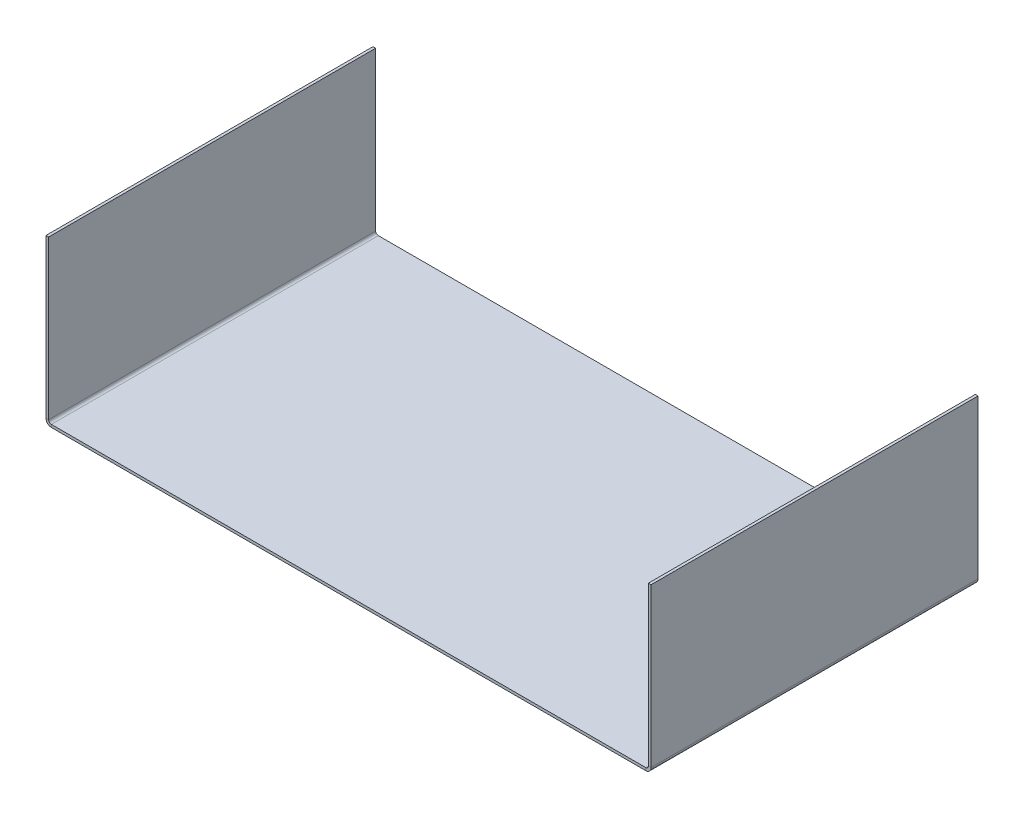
ISO-10303-21;
HEADER;
FILE_DESCRIPTION(('STEP AP214'),'2;1');
FILE_NAME('part.step','',(''),(''),'','','');
FILE_SCHEMA(('AUTOMOTIVE_DESIGN { 1 0 10303 214 1 1 1 1 }'));
ENDSEC;
DATA;
#1=APPLICATION_CONTEXT('core data for automotive mechanical design processes');
#2=APPLICATION_PROTOCOL_DEFINITION('international standard','automotive_design',2000,#1);
#3=PRODUCT_CONTEXT('',#1,'mechanical');
#4=PRODUCT('Part','Part','',(#3));
#5=PRODUCT_RELATED_PRODUCT_CATEGORY('part','',(#4));
#6=PRODUCT_DEFINITION_FORMATION('','',#4);
#7=PRODUCT_DEFINITION_CONTEXT('part definition',#1,'design');
#8=PRODUCT_DEFINITION('design','',#6,#7);
#9=PRODUCT_DEFINITION_SHAPE('','',#8);
#10=(LENGTH_UNIT() NAMED_UNIT(*) SI_UNIT(.MILLI.,.METRE.));
#11=(NAMED_UNIT(*) PLANE_ANGLE_UNIT() SI_UNIT($,.RADIAN.));
#12=(NAMED_UNIT(*) SI_UNIT($,.STERADIAN.) SOLID_ANGLE_UNIT());
#13=UNCERTAINTY_MEASURE_WITH_UNIT(LENGTH_MEASURE(1.E-05),#10,'distance_accuracy_value','');
#14=(GEOMETRIC_REPRESENTATION_CONTEXT(3) GLOBAL_UNCERTAINTY_ASSIGNED_CONTEXT((#13)) GLOBAL_UNIT_ASSIGNED_CONTEXT((#10,
#11,#12)) REPRESENTATION_CONTEXT('',''));
#15=CARTESIAN_POINT('',(0.,0.,0.));
#16=DIRECTION('',(0.,0.,1.));
#17=DIRECTION('',(1.,0.,0.));
#18=AXIS2_PLACEMENT_3D('',#15,#16,#17);
#19=CARTESIAN_POINT('',(0.,-0.7366,0.));
#20=DIRECTION('',(0.,1.,0.));
#21=DIRECTION('',(0.,0.,1.));
#22=AXIS2_PLACEMENT_3D('',#19,#20,#21);
#23=PLANE('',#22);
#24=DIRECTION('',(0.,0.,-1.));
#25=VECTOR('',#24,1.);
#26=CARTESIAN_POINT('',(76.8963049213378,-0.736599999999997,-44.5016904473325));
#27=LINE('',#26,#25);
#28=CARTESIAN_POINT('',(76.8963049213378,-0.736599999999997,-44.5016904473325));
#29=VERTEX_POINT('',#28);
#30=CARTESIAN_POINT('',(76.8963049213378,-0.7366,45.2858612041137));
#31=VERTEX_POINT('',#30);
#32=EDGE_CURVE('E133',#29,#31,#27,.F.);
#33=ORIENTED_EDGE('',*,*,#32,.T.);
#34=DIRECTION('',(1.,0.,0.));
#35=VECTOR('',#34,1.);
#36=CARTESIAN_POINT('',(-87.0429540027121,-0.7366,45.2858612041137));
#37=LINE('',#36,#35);
#38=CARTESIAN_POINT('',(-86.3063540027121,-0.736599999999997,45.2858612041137));
#39=VERTEX_POINT('',#38);
#40=EDGE_CURVE('E44',#39,#31,#37,.T.);
#41=ORIENTED_EDGE('',*,*,#40,.F.);
#42=DIRECTION('',(0.,0.,1.));
#43=VECTOR('',#42,1.);
#44=CARTESIAN_POINT('',(-86.3063540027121,-0.736599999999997,45.2858612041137));
#45=LINE('',#44,#43);
#46=CARTESIAN_POINT('',(-86.3063540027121,-0.7366,-44.5016904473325));
#47=VERTEX_POINT('',#46);
#48=EDGE_CURVE('E222',#39,#47,#45,.F.);
#49=ORIENTED_EDGE('',*,*,#48,.T.);
#50=DIRECTION('',(-1.,0.,0.));
#51=VECTOR('',#50,1.);
#52=CARTESIAN_POINT('',(-87.0429540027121,-0.7366,-44.5016904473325));
#53=LINE('',#52,#51);
#54=EDGE_CURVE('E11',#29,#47,#53,.T.);
#55=ORIENTED_EDGE('',*,*,#54,.F.);
#56=EDGE_LOOP('',(#33,#41,#49,#55));
#57=FACE_BOUND('',#56,.T.);
#58=ADVANCED_FACE('F35',(#57),#23,.F.);
#59=CARTESIAN_POINT('',(0.,0.,0.));
#60=DIRECTION('',(0.,1.,0.));
#61=DIRECTION('',(0.,0.,1.));
#62=AXIS2_PLACEMENT_3D('',#59,#60,#61);
#63=PLANE('',#62);
#64=DIRECTION('',(1.,0.,0.));
#65=VECTOR('',#64,1.);
#66=CARTESIAN_POINT('',(-87.0429540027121,0.,45.2858612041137));
#67=LINE('',#66,#65);
#68=CARTESIAN_POINT('',(-86.3063540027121,0.,45.2858612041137));
#69=VERTEX_POINT('',#68);
#70=CARTESIAN_POINT('',(76.8963049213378,0.,45.2858612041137));
#71=VERTEX_POINT('',#70);
#72=EDGE_CURVE('E240',#69,#71,#67,.T.);
#73=ORIENTED_EDGE('',*,*,#72,.T.);
#74=DIRECTION('',(0.,0.,-1.));
#75=VECTOR('',#74,1.);
#76=CARTESIAN_POINT('',(76.8963049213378,0.,-44.5016904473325));
#77=LINE('',#76,#75);
#78=CARTESIAN_POINT('',(76.8963049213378,0.,-44.5016904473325));
#79=VERTEX_POINT('',#78);
#80=EDGE_CURVE('E183',#79,#71,#77,.F.);
#81=ORIENTED_EDGE('',*,*,#80,.F.);
#82=DIRECTION('',(-1.,0.,0.));
#83=VECTOR('',#82,1.);
#84=CARTESIAN_POINT('',(-87.0429540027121,0.,-44.5016904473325));
#85=LINE('',#84,#83);
#86=CARTESIAN_POINT('',(-86.3063540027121,0.,-44.5016904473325));
#87=VERTEX_POINT('',#86);
#88=EDGE_CURVE('E39',#79,#87,#85,.T.);
#89=ORIENTED_EDGE('',*,*,#88,.T.);
#90=DIRECTION('',(0.,0.,1.));
#91=VECTOR('',#90,1.);
#92=CARTESIAN_POINT('',(-86.3063540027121,0.,45.2858612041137));
#93=LINE('',#92,#91);
#94=EDGE_CURVE('E52',#69,#87,#93,.F.);
#95=ORIENTED_EDGE('',*,*,#94,.F.);
#96=EDGE_LOOP('',(#73,#81,#89,#95));
#97=FACE_BOUND('',#96,.T.);
#98=ADVANCED_FACE('F245',(#97),#63,.T.);
#99=CARTESIAN_POINT('',(-87.0429540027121,-0.7366,-44.5016904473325));
#100=DIRECTION('',(0.,0.,-1.));
#101=DIRECTION('',(-1.,0.,0.));
#102=AXIS2_PLACEMENT_3D('',#99,#100,#101);
#103=PLANE('',#102);
#104=ORIENTED_EDGE('',*,*,#88,.F.);
#105=DIRECTION('',(0.,-1.,0.));
#106=VECTOR('',#105,1.);
#107=CARTESIAN_POINT('',(76.8963049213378,0.,-44.5016904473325));
#108=LINE('',#107,#106);
#109=EDGE_CURVE('E179',#79,#29,#108,.T.);
#110=ORIENTED_EDGE('',*,*,#109,.T.);
#111=ORIENTED_EDGE('',*,*,#54,.T.);
#112=DIRECTION('',(0.,-1.,0.));
#113=VECTOR('',#112,1.);
#114=CARTESIAN_POINT('',(-86.3063540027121,0.,-44.5016904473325));
#115=LINE('',#114,#113);
#116=EDGE_CURVE('E237',#87,#47,#115,.T.);
#117=ORIENTED_EDGE('',*,*,#116,.F.);
#118=EDGE_LOOP('',(#104,#110,#111,#117));
#119=FACE_BOUND('',#118,.T.);
#120=ADVANCED_FACE('F246',(#119),#103,.T.);
#121=CARTESIAN_POINT('',(-87.0429540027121,-0.7366,45.2858612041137));
#122=DIRECTION('',(0.,0.,1.));
#123=DIRECTION('',(1.,0.,0.));
#124=AXIS2_PLACEMENT_3D('',#121,#122,#123);
#125=PLANE('',#124);
#126=DIRECTION('',(0.,-1.,0.));
#127=VECTOR('',#126,1.);
#128=CARTESIAN_POINT('',(76.8963049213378,0.,45.2858612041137));
#129=LINE('',#128,#127);
#130=EDGE_CURVE('E187',#71,#31,#129,.T.);
#131=ORIENTED_EDGE('',*,*,#130,.F.);
#132=ORIENTED_EDGE('',*,*,#72,.F.);
#133=DIRECTION('',(0.,-1.,0.));
#134=VECTOR('',#133,1.);
#135=CARTESIAN_POINT('',(-86.3063540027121,0.,45.2858612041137));
#136=LINE('',#135,#134);
#137=EDGE_CURVE('E228',#69,#39,#136,.T.);
#138=ORIENTED_EDGE('',*,*,#137,.T.);
#139=ORIENTED_EDGE('',*,*,#40,.T.);
#140=EDGE_LOOP('',(#131,#132,#138,#139));
#141=FACE_BOUND('',#140,.T.);
#142=ADVANCED_FACE('F37',(#141),#125,.T.);
#143=CARTESIAN_POINT('',(-86.3063540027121,0.736600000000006,-44.5016904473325));
#144=DIRECTION('',(0.,0.,-1.));
#145=DIRECTION('',(-1.,0.,0.));
#146=AXIS2_PLACEMENT_3D('',#143,#144,#145);
#147=PLANE('',#146);
#148=DIRECTION('',(-1.,0.,0.));
#149=VECTOR('',#148,1.);
#150=CARTESIAN_POINT('',(-87.0429540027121,0.736600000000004,-44.5016904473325));
#151=LINE('',#150,#149);
#152=CARTESIAN_POINT('',(-87.0429540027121,0.736600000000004,-44.5016904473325));
#153=VERTEX_POINT('',#152);
#154=CARTESIAN_POINT('',(-87.7795540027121,0.736600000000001,-44.5016904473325));
#155=VERTEX_POINT('',#154);
#156=EDGE_CURVE('E190',#153,#155,#151,.T.);
#157=ORIENTED_EDGE('',*,*,#156,.F.);
#158=CARTESIAN_POINT('',(-86.3063540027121,0.736600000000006,-44.5016904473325));
#159=DIRECTION('',(0.,0.,1.));
#160=DIRECTION('',(1.,0.,0.));
#161=AXIS2_PLACEMENT_3D('',#158,#159,#160);
#162=CIRCLE('',#161,0.736600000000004);
#163=EDGE_CURVE('E231',#87,#153,#162,.F.);
#164=ORIENTED_EDGE('',*,*,#163,.F.);
#165=ORIENTED_EDGE('',*,*,#116,.T.);
#166=CARTESIAN_POINT('',(-86.3063540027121,0.736600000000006,-44.5016904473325));
#167=DIRECTION('',(0.,0.,1.));
#168=DIRECTION('',(1.,0.,0.));
#169=AXIS2_PLACEMENT_3D('',#166,#167,#168);
#170=CIRCLE('',#169,1.4732);
#171=EDGE_CURVE('E224',#47,#155,#170,.F.);
#172=ORIENTED_EDGE('',*,*,#171,.T.);
#173=EDGE_LOOP('',(#157,#164,#165,#172));
#174=FACE_BOUND('',#173,.T.);
#175=ADVANCED_FACE('F254',(#174),#147,.T.);
#176=CARTESIAN_POINT('',(-86.3063540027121,0.736600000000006,45.2858612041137));
#177=DIRECTION('',(0.,0.,-1.));
#178=DIRECTION('',(-1.,0.,0.));
#179=AXIS2_PLACEMENT_3D('',#176,#177,#178);
#180=PLANE('',#179);
#181=CARTESIAN_POINT('',(-86.3063540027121,0.736600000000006,45.2858612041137));
#182=DIRECTION('',(0.,0.,1.));
#183=DIRECTION('',(1.,0.,0.));
#184=AXIS2_PLACEMENT_3D('',#181,#182,#183);
#185=CIRCLE('',#184,0.736600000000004);
#186=CARTESIAN_POINT('',(-87.0429540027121,0.736600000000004,45.2858612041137));
#187=VERTEX_POINT('',#186);
#188=EDGE_CURVE('E221',#187,#69,#185,.T.);
#189=ORIENTED_EDGE('',*,*,#188,.F.);
#190=DIRECTION('',(-1.,0.,0.));
#191=VECTOR('',#190,1.);
#192=CARTESIAN_POINT('',(-87.0429540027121,0.736600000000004,45.2858612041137));
#193=LINE('',#192,#191);
#194=CARTESIAN_POINT('',(-87.7795540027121,0.736600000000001,45.2858612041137));
#195=VERTEX_POINT('',#194);
#196=EDGE_CURVE('E194',#187,#195,#193,.T.);
#197=ORIENTED_EDGE('',*,*,#196,.T.);
#198=CARTESIAN_POINT('',(-86.3063540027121,0.736600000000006,45.2858612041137));
#199=DIRECTION('',(0.,0.,1.));
#200=DIRECTION('',(1.,0.,0.));
#201=AXIS2_PLACEMENT_3D('',#198,#199,#200);
#202=CIRCLE('',#201,1.4732);
#203=EDGE_CURVE('E225',#195,#39,#202,.T.);
#204=ORIENTED_EDGE('',*,*,#203,.T.);
#205=ORIENTED_EDGE('',*,*,#137,.F.);
#206=EDGE_LOOP('',(#189,#197,#204,#205));
#207=FACE_BOUND('',#206,.T.);
#208=ADVANCED_FACE('F275',(#207),#180,.F.);
#209=CARTESIAN_POINT('',(-86.3063540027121,0.736600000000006,45.2858612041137));
#210=DIRECTION('',(0.,0.,1.));
#211=DIRECTION('',(-1.,0.,0.));
#212=AXIS2_PLACEMENT_3D('',#209,#210,#211);
#213=CYLINDRICAL_SURFACE('',#212,1.4732);
#214=ORIENTED_EDGE('',*,*,#48,.F.);
#215=ORIENTED_EDGE('',*,*,#203,.F.);
#216=DIRECTION('',(0.,0.,-1.));
#217=VECTOR('',#216,1.);
#218=CARTESIAN_POINT('',(-87.7795540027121,0.736600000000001,0.));
#219=LINE('',#218,#217);
#220=EDGE_CURVE('E197',#195,#155,#219,.T.);
#221=ORIENTED_EDGE('',*,*,#220,.T.);
#222=ORIENTED_EDGE('',*,*,#171,.F.);
#223=EDGE_LOOP('',(#214,#215,#221,#222));
#224=FACE_BOUND('',#223,.T.);
#225=ADVANCED_FACE('F452',(#224),#213,.T.);
#226=CARTESIAN_POINT('',(-86.3063540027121,0.736600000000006,45.2858612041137));
#227=DIRECTION('',(0.,0.,1.));
#228=DIRECTION('',(-1.,0.,0.));
#229=AXIS2_PLACEMENT_3D('',#226,#227,#228);
#230=CYLINDRICAL_SURFACE('',#229,0.736600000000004);
#231=ORIENTED_EDGE('',*,*,#94,.T.);
#232=ORIENTED_EDGE('',*,*,#163,.T.);
#233=DIRECTION('',(0.,0.,1.));
#234=VECTOR('',#233,1.);
#235=CARTESIAN_POINT('',(-87.0429540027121,0.736600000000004,-44.5016904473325));
#236=LINE('',#235,#234);
#237=EDGE_CURVE('E192',#153,#187,#236,.T.);
#238=ORIENTED_EDGE('',*,*,#237,.T.);
#239=ORIENTED_EDGE('',*,*,#188,.T.);
#240=EDGE_LOOP('',(#231,#232,#238,#239));
#241=FACE_BOUND('',#240,.T.);
#242=ADVANCED_FACE('F251',(#241),#230,.F.);
#243=CARTESIAN_POINT('',(-87.7795540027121,0.,-44.5016904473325));
#244=DIRECTION('',(0.,0.,1.));
#245=DIRECTION('',(1.,0.,0.));
#246=AXIS2_PLACEMENT_3D('',#243,#244,#245);
#247=PLANE('',#246);
#248=ORIENTED_EDGE('',*,*,#156,.T.);
#249=DIRECTION('',(0.,-1.,0.));
#250=VECTOR('',#249,1.);
#251=CARTESIAN_POINT('',(-87.7795540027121,0.,-44.5016904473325));
#252=LINE('',#251,#250);
#253=CARTESIAN_POINT('',(-87.7795540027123,44.2098,-44.5016904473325));
#254=VERTEX_POINT('',#253);
#255=EDGE_CURVE('E202',#254,#155,#252,.T.);
#256=ORIENTED_EDGE('',*,*,#255,.F.);
#257=DIRECTION('',(1.,0.,0.));
#258=VECTOR('',#257,1.);
#259=CARTESIAN_POINT('',(-87.7795540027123,44.2098,-44.5016904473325));
#260=LINE('',#259,#258);
#261=CARTESIAN_POINT('',(-87.0429540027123,44.2098,-44.5016904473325));
#262=VERTEX_POINT('',#261);
#263=EDGE_CURVE('E210',#254,#262,#260,.T.);
#264=ORIENTED_EDGE('',*,*,#263,.T.);
#265=DIRECTION('',(0.,-1.,0.));
#266=VECTOR('',#265,1.);
#267=CARTESIAN_POINT('',(-87.0429540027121,0.,-44.5016904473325));
#268=LINE('',#267,#266);
#269=EDGE_CURVE('E201',#262,#153,#268,.T.);
#270=ORIENTED_EDGE('',*,*,#269,.T.);
#271=EDGE_LOOP('',(#248,#256,#264,#270));
#272=FACE_BOUND('',#271,.T.);
#273=ADVANCED_FACE('F257',(#272),#247,.F.);
#274=CARTESIAN_POINT('',(-87.7795540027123,44.2098,45.2858612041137));
#275=DIRECTION('',(0.,0.,-1.));
#276=DIRECTION('',(-1.,0.,0.));
#277=AXIS2_PLACEMENT_3D('',#274,#275,#276);
#278=PLANE('',#277);
#279=ORIENTED_EDGE('',*,*,#196,.F.);
#280=DIRECTION('',(0.,1.,0.));
#281=VECTOR('',#280,1.);
#282=CARTESIAN_POINT('',(-87.0429540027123,44.2098,45.2858612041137));
#283=LINE('',#282,#281);
#284=CARTESIAN_POINT('',(-87.0429540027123,44.2098,45.2858612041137));
#285=VERTEX_POINT('',#284);
#286=EDGE_CURVE('E213',#187,#285,#283,.T.);
#287=ORIENTED_EDGE('',*,*,#286,.T.);
#288=DIRECTION('',(1.,0.,0.));
#289=VECTOR('',#288,1.);
#290=CARTESIAN_POINT('',(-87.7795540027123,44.2098,45.2858612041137));
#291=LINE('',#290,#289);
#292=CARTESIAN_POINT('',(-87.7795540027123,44.2098,45.2858612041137));
#293=VERTEX_POINT('',#292);
#294=EDGE_CURVE('E218',#293,#285,#291,.T.);
#295=ORIENTED_EDGE('',*,*,#294,.F.);
#296=DIRECTION('',(0.,1.,0.));
#297=VECTOR('',#296,1.);
#298=CARTESIAN_POINT('',(-87.7795540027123,44.2098,45.2858612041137));
#299=LINE('',#298,#297);
#300=EDGE_CURVE('E205',#195,#293,#299,.T.);
#301=ORIENTED_EDGE('',*,*,#300,.F.);
#302=EDGE_LOOP('',(#279,#287,#295,#301));
#303=FACE_BOUND('',#302,.T.);
#304=ADVANCED_FACE('F277',(#303),#278,.F.);
#305=CARTESIAN_POINT('',(-87.7795540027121,-3.03129622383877E-13,0.));
#306=DIRECTION('',(1.,0.,0.));
#307=DIRECTION('',(0.,1.,0.));
#308=AXIS2_PLACEMENT_3D('',#305,#306,#307);
#309=PLANE('',#308);
#310=ORIENTED_EDGE('',*,*,#220,.F.);
#311=ORIENTED_EDGE('',*,*,#300,.T.);
#312=DIRECTION('',(0.,0.,-1.));
#313=VECTOR('',#312,1.);
#314=CARTESIAN_POINT('',(-87.7795540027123,44.2098,-44.5016904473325));
#315=LINE('',#314,#313);
#316=EDGE_CURVE('E208',#293,#254,#315,.T.);
#317=ORIENTED_EDGE('',*,*,#316,.T.);
#318=ORIENTED_EDGE('',*,*,#255,.T.);
#319=EDGE_LOOP('',(#310,#311,#317,#318));
#320=FACE_BOUND('',#319,.T.);
#321=ADVANCED_FACE('F261',(#320),#309,.F.);
#322=CARTESIAN_POINT('',(-87.0429540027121,-3.00557797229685E-13,0.));
#323=DIRECTION('',(1.,0.,0.));
#324=DIRECTION('',(0.,1.,0.));
#325=AXIS2_PLACEMENT_3D('',#322,#323,#324);
#326=PLANE('',#325);
#327=ORIENTED_EDGE('',*,*,#286,.F.);
#328=ORIENTED_EDGE('',*,*,#237,.F.);
#329=ORIENTED_EDGE('',*,*,#269,.F.);
#330=DIRECTION('',(0.,0.,-1.));
#331=VECTOR('',#330,1.);
#332=CARTESIAN_POINT('',(-87.0429540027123,44.2098,-44.5016904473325));
#333=LINE('',#332,#331);
#334=EDGE_CURVE('E206',#285,#262,#333,.T.);
#335=ORIENTED_EDGE('',*,*,#334,.F.);
#336=EDGE_LOOP('',(#327,#328,#329,#335));
#337=FACE_BOUND('',#336,.T.);
#338=ADVANCED_FACE('F271',(#337),#326,.T.);
#339=CARTESIAN_POINT('',(-87.7795540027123,44.2098,-44.5016904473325));
#340=DIRECTION('',(0.,-1.,0.));
#341=DIRECTION('',(1.,0.,0.));
#342=AXIS2_PLACEMENT_3D('',#339,#340,#341);
#343=PLANE('',#342);
#344=ORIENTED_EDGE('',*,*,#334,.T.);
#345=ORIENTED_EDGE('',*,*,#263,.F.);
#346=ORIENTED_EDGE('',*,*,#316,.F.);
#347=ORIENTED_EDGE('',*,*,#294,.T.);
#348=EDGE_LOOP('',(#344,#345,#346,#347));
#349=FACE_BOUND('',#348,.T.);
#350=ADVANCED_FACE('F267',(#349),#343,.F.);
#351=CARTESIAN_POINT('',(76.8963049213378,0.736600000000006,45.2858612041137));
#352=DIRECTION('',(0.,0.,1.));
#353=DIRECTION('',(1.,0.,0.));
#354=AXIS2_PLACEMENT_3D('',#351,#352,#353);
#355=PLANE('',#354);
#356=DIRECTION('',(1.,0.,0.));
#357=VECTOR('',#356,1.);
#358=CARTESIAN_POINT('',(77.6329049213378,0.736600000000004,45.2858612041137));
#359=LINE('',#358,#357);
#360=CARTESIAN_POINT('',(77.6329049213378,0.736600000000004,45.2858612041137));
#361=VERTEX_POINT('',#360);
#362=CARTESIAN_POINT('',(78.3695049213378,0.736600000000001,45.2858612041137));
#363=VERTEX_POINT('',#362);
#364=EDGE_CURVE('E308',#361,#363,#359,.T.);
#365=ORIENTED_EDGE('',*,*,#364,.F.);
#366=CARTESIAN_POINT('',(76.8963049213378,0.736600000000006,45.2858612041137));
#367=DIRECTION('',(0.,0.,-1.));
#368=DIRECTION('',(-1.,0.,0.));
#369=AXIS2_PLACEMENT_3D('',#366,#367,#368);
#370=CIRCLE('',#369,0.736600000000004);
#371=EDGE_CURVE('E136',#71,#361,#370,.F.);
#372=ORIENTED_EDGE('',*,*,#371,.F.);
#373=ORIENTED_EDGE('',*,*,#130,.T.);
#374=CARTESIAN_POINT('',(76.8963049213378,0.736600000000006,45.2858612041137));
#375=DIRECTION('',(0.,0.,-1.));
#376=DIRECTION('',(-1.,0.,0.));
#377=AXIS2_PLACEMENT_3D('',#374,#375,#376);
#378=CIRCLE('',#377,1.4732);
#379=EDGE_CURVE('E178',#31,#363,#378,.F.);
#380=ORIENTED_EDGE('',*,*,#379,.T.);
#381=EDGE_LOOP('',(#365,#372,#373,#380));
#382=FACE_BOUND('',#381,.T.);
#383=ADVANCED_FACE('F306',(#382),#355,.T.);
#384=CARTESIAN_POINT('',(76.8963049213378,0.736600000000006,-44.5016904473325));
#385=DIRECTION('',(0.,0.,1.));
#386=DIRECTION('',(1.,0.,0.));
#387=AXIS2_PLACEMENT_3D('',#384,#385,#386);
#388=PLANE('',#387);
#389=CARTESIAN_POINT('',(76.8963049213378,0.736600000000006,-44.5016904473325));
#390=DIRECTION('',(0.,0.,-1.));
#391=DIRECTION('',(-1.,0.,0.));
#392=AXIS2_PLACEMENT_3D('',#389,#390,#391);
#393=CIRCLE('',#392,0.736600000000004);
#394=CARTESIAN_POINT('',(77.6329049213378,0.736600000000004,-44.5016904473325));
#395=VERTEX_POINT('',#394);
#396=EDGE_CURVE('E143',#395,#79,#393,.T.);
#397=ORIENTED_EDGE('',*,*,#396,.F.);
#398=DIRECTION('',(1.,0.,0.));
#399=VECTOR('',#398,1.);
#400=CARTESIAN_POINT('',(77.6329049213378,0.736600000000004,-44.5016904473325));
#401=LINE('',#400,#399);
#402=CARTESIAN_POINT('',(78.3695049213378,0.736600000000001,-44.5016904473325));
#403=VERTEX_POINT('',#402);
#404=EDGE_CURVE('E140',#395,#403,#401,.T.);
#405=ORIENTED_EDGE('',*,*,#404,.T.);
#406=CARTESIAN_POINT('',(76.8963049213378,0.736600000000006,-44.5016904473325));
#407=DIRECTION('',(0.,0.,-1.));
#408=DIRECTION('',(-1.,0.,0.));
#409=AXIS2_PLACEMENT_3D('',#406,#407,#408);
#410=CIRCLE('',#409,1.4732);
#411=EDGE_CURVE('E126',#403,#29,#410,.T.);
#412=ORIENTED_EDGE('',*,*,#411,.T.);
#413=ORIENTED_EDGE('',*,*,#109,.F.);
#414=EDGE_LOOP('',(#397,#405,#412,#413));
#415=FACE_BOUND('',#414,.T.);
#416=ADVANCED_FACE('F141',(#415),#388,.F.);
#417=CARTESIAN_POINT('',(76.8963049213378,0.736600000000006,-44.5016904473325));
#418=DIRECTION('',(0.,0.,-1.));
#419=DIRECTION('',(1.,0.,0.));
#420=AXIS2_PLACEMENT_3D('',#417,#418,#419);
#421=CYLINDRICAL_SURFACE('',#420,1.4732);
#422=ORIENTED_EDGE('',*,*,#32,.F.);
#423=ORIENTED_EDGE('',*,*,#411,.F.);
#424=DIRECTION('',(0.,0.,1.));
#425=VECTOR('',#424,1.);
#426=CARTESIAN_POINT('',(78.3695049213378,0.736600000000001,0.));
#427=LINE('',#426,#425);
#428=EDGE_CURVE('E131',#403,#363,#427,.T.);
#429=ORIENTED_EDGE('',*,*,#428,.T.);
#430=ORIENTED_EDGE('',*,*,#379,.F.);
#431=EDGE_LOOP('',(#422,#423,#429,#430));
#432=FACE_BOUND('',#431,.T.);
#433=ADVANCED_FACE('F128',(#432),#421,.T.);
#434=CARTESIAN_POINT('',(76.8963049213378,0.736600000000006,-44.5016904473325));
#435=DIRECTION('',(0.,0.,-1.));
#436=DIRECTION('',(1.,0.,0.));
#437=AXIS2_PLACEMENT_3D('',#434,#435,#436);
#438=CYLINDRICAL_SURFACE('',#437,0.736600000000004);
#439=ORIENTED_EDGE('',*,*,#80,.T.);
#440=ORIENTED_EDGE('',*,*,#371,.T.);
#441=DIRECTION('',(0.,0.,-1.));
#442=VECTOR('',#441,1.);
#443=CARTESIAN_POINT('',(77.6329049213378,0.736600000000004,45.2858612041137));
#444=LINE('',#443,#442);
#445=EDGE_CURVE('E147',#361,#395,#444,.T.);
#446=ORIENTED_EDGE('',*,*,#445,.T.);
#447=ORIENTED_EDGE('',*,*,#396,.T.);
#448=EDGE_LOOP('',(#439,#440,#446,#447));
#449=FACE_BOUND('',#448,.T.);
#450=ADVANCED_FACE('F311',(#449),#438,.F.);
#451=CARTESIAN_POINT('',(78.3695049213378,0.,45.2858612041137));
#452=DIRECTION('',(0.,0.,-1.));
#453=DIRECTION('',(-1.,0.,0.));
#454=AXIS2_PLACEMENT_3D('',#451,#452,#453);
#455=PLANE('',#454);
#456=ORIENTED_EDGE('',*,*,#364,.T.);
#457=DIRECTION('',(0.,-1.,0.));
#458=VECTOR('',#457,1.);
#459=CARTESIAN_POINT('',(78.3695049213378,0.,45.2858612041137));
#460=LINE('',#459,#458);
#461=CARTESIAN_POINT('',(78.3695049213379,44.2098,45.2858612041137));
#462=VERTEX_POINT('',#461);
#463=EDGE_CURVE('E155',#462,#363,#460,.T.);
#464=ORIENTED_EDGE('',*,*,#463,.F.);
#465=DIRECTION('',(-1.,0.,0.));
#466=VECTOR('',#465,1.);
#467=CARTESIAN_POINT('',(78.3695049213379,44.2098,45.2858612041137));
#468=LINE('',#467,#466);
#469=CARTESIAN_POINT('',(77.6329049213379,44.2098,45.2858612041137));
#470=VERTEX_POINT('',#469);
#471=EDGE_CURVE('E164',#462,#470,#468,.T.);
#472=ORIENTED_EDGE('',*,*,#471,.T.);
#473=DIRECTION('',(0.,-1.,0.));
#474=VECTOR('',#473,1.);
#475=CARTESIAN_POINT('',(77.6329049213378,0.,45.2858612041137));
#476=LINE('',#475,#474);
#477=EDGE_CURVE('E156',#470,#361,#476,.T.);
#478=ORIENTED_EDGE('',*,*,#477,.T.);
#479=EDGE_LOOP('',(#456,#464,#472,#478));
#480=FACE_BOUND('',#479,.T.);
#481=ADVANCED_FACE('F318',(#480),#455,.F.);
#482=CARTESIAN_POINT('',(78.3695049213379,44.2098,-44.5016904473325));
#483=DIRECTION('',(0.,0.,1.));
#484=DIRECTION('',(1.,0.,0.));
#485=AXIS2_PLACEMENT_3D('',#482,#483,#484);
#486=PLANE('',#485);
#487=ORIENTED_EDGE('',*,*,#404,.F.);
#488=DIRECTION('',(0.,1.,0.));
#489=VECTOR('',#488,1.);
#490=CARTESIAN_POINT('',(77.6329049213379,44.2098,-44.5016904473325));
#491=LINE('',#490,#489);
#492=CARTESIAN_POINT('',(77.6329049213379,44.2098,-44.5016904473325));
#493=VERTEX_POINT('',#492);
#494=EDGE_CURVE('E171',#395,#493,#491,.T.);
#495=ORIENTED_EDGE('',*,*,#494,.T.);
#496=DIRECTION('',(-1.,0.,0.));
#497=VECTOR('',#496,1.);
#498=CARTESIAN_POINT('',(78.3695049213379,44.2098,-44.5016904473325));
#499=LINE('',#498,#497);
#500=CARTESIAN_POINT('',(78.3695049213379,44.2098,-44.5016904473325));
#501=VERTEX_POINT('',#500);
#502=EDGE_CURVE('E160',#501,#493,#499,.T.);
#503=ORIENTED_EDGE('',*,*,#502,.F.);
#504=DIRECTION('',(0.,1.,0.));
#505=VECTOR('',#504,1.);
#506=CARTESIAN_POINT('',(78.3695049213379,44.2098,-44.5016904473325));
#507=LINE('',#506,#505);
#508=EDGE_CURVE('E152',#403,#501,#507,.T.);
#509=ORIENTED_EDGE('',*,*,#508,.F.);
#510=EDGE_LOOP('',(#487,#495,#503,#509));
#511=FACE_BOUND('',#510,.T.);
#512=ADVANCED_FACE('F158',(#511),#486,.F.);
#513=CARTESIAN_POINT('',(78.3695049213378,-2.70636887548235E-13,0.));
#514=DIRECTION('',(-1.,0.,0.));
#515=DIRECTION('',(0.,-1.,0.));
#516=AXIS2_PLACEMENT_3D('',#513,#514,#515);
#517=PLANE('',#516);
#518=ORIENTED_EDGE('',*,*,#428,.F.);
#519=ORIENTED_EDGE('',*,*,#508,.T.);
#520=DIRECTION('',(0.,0.,1.));
#521=VECTOR('',#520,1.);
#522=CARTESIAN_POINT('',(78.3695049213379,44.2098,45.2858612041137));
#523=LINE('',#522,#521);
#524=EDGE_CURVE('E162',#501,#462,#523,.T.);
#525=ORIENTED_EDGE('',*,*,#524,.T.);
#526=ORIENTED_EDGE('',*,*,#463,.T.);
#527=EDGE_LOOP('',(#518,#519,#525,#526));
#528=FACE_BOUND('',#527,.T.);
#529=ADVANCED_FACE('F151',(#528),#517,.F.);
#530=CARTESIAN_POINT('',(77.6329049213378,-2.68065062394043E-13,0.));
#531=DIRECTION('',(-1.,0.,0.));
#532=DIRECTION('',(0.,-1.,0.));
#533=AXIS2_PLACEMENT_3D('',#530,#531,#532);
#534=PLANE('',#533);
#535=ORIENTED_EDGE('',*,*,#494,.F.);
#536=ORIENTED_EDGE('',*,*,#445,.F.);
#537=ORIENTED_EDGE('',*,*,#477,.F.);
#538=DIRECTION('',(0.,0.,1.));
#539=VECTOR('',#538,1.);
#540=CARTESIAN_POINT('',(77.6329049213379,44.2098,45.2858612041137));
#541=LINE('',#540,#539);
#542=EDGE_CURVE('E166',#493,#470,#541,.T.);
#543=ORIENTED_EDGE('',*,*,#542,.F.);
#544=EDGE_LOOP('',(#535,#536,#537,#543));
#545=FACE_BOUND('',#544,.T.);
#546=ADVANCED_FACE('F314',(#545),#534,.T.);
#547=CARTESIAN_POINT('',(78.3695049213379,44.2098,45.2858612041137));
#548=DIRECTION('',(0.,-1.,0.));
#549=DIRECTION('',(1.,0.,0.));
#550=AXIS2_PLACEMENT_3D('',#547,#548,#549);
#551=PLANE('',#550);
#552=ORIENTED_EDGE('',*,*,#542,.T.);
#553=ORIENTED_EDGE('',*,*,#471,.F.);
#554=ORIENTED_EDGE('',*,*,#524,.F.);
#555=ORIENTED_EDGE('',*,*,#502,.T.);
#556=EDGE_LOOP('',(#552,#553,#554,#555));
#557=FACE_BOUND('',#556,.T.);
#558=ADVANCED_FACE('F321',(#557),#551,.F.);
#559=CLOSED_SHELL('',(#58,#98,#120,#142,#175,#208,#225,#242,#273,#304,#321,#338,#350,#383,#416,
#433,#450,#481,#512,#529,#546,#558));
#560=MANIFOLD_SOLID_BREP('B2',#559);
#561=ADVANCED_BREP_SHAPE_REPRESENTATION('',(#18,#560),#14);
#562=SHAPE_DEFINITION_REPRESENTATION(#9,#561);
ENDSEC;
END-ISO-10303-21;
